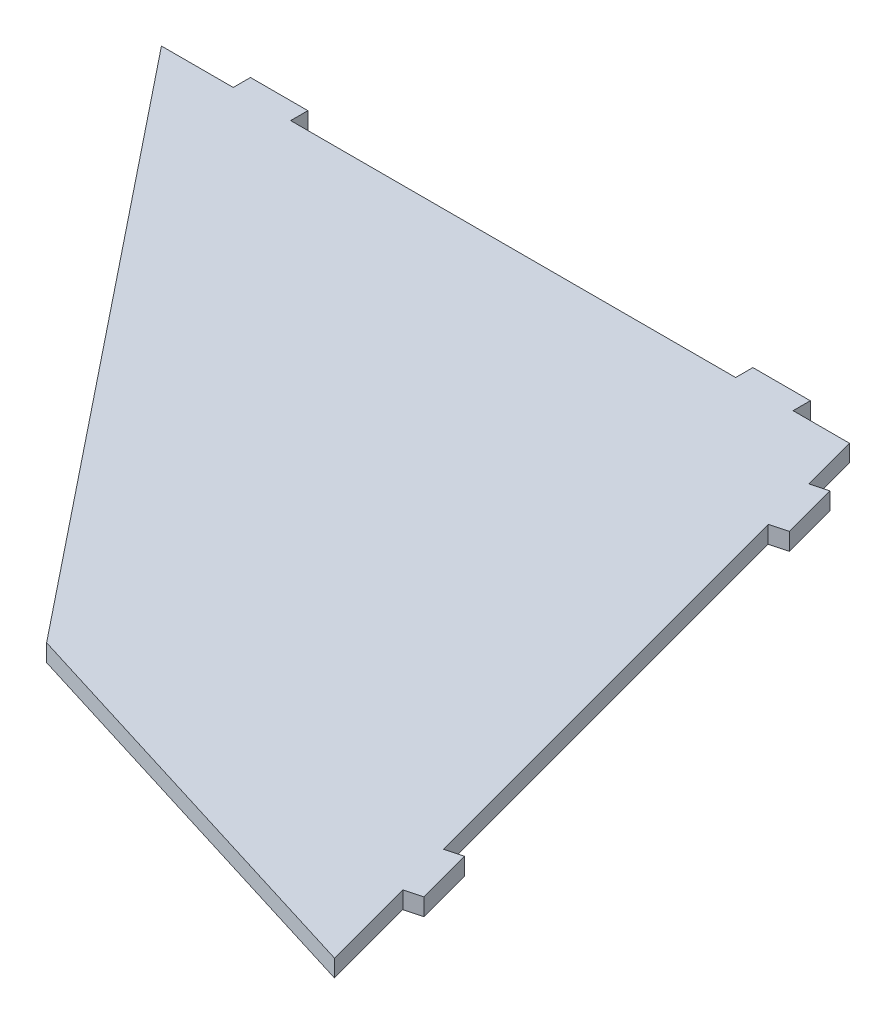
from build123d import *

# Parameters (mm, degrees)
AUFSATZ_LINEAR_AUSTRAGEN1_DEPTH = 6


with BuildPart() as part:
    # Skizze1 → Aufsatz-Linear austragen1 (new body)
    with BuildSketch(Plane(origin=(0, 0, 0), x_dir=(1, 0, 0), z_dir=(0, 1, 0))):
        Polygon((90.58717813, -17.765602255), (95.763559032, -37.084118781), (89.968004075, -38.637033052), (131.379051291, -193.185165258), (137.174606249, -191.632250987), (142.350987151, -210.950767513), (136.555432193, -212.503681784), (145.262794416, -245), (0, -200), (-160, 0), (-135, 0), (-135, 6), (-115, 6), (-115, 0), (40, 0), (40, 6), (60, 6), (60, 0), (79.615242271, 0), (84.791623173, -19.318516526), align=None)
    extrude(amount=AUFSATZ_LINEAR_AUSTRAGEN1_DEPTH)


solid = part.part
